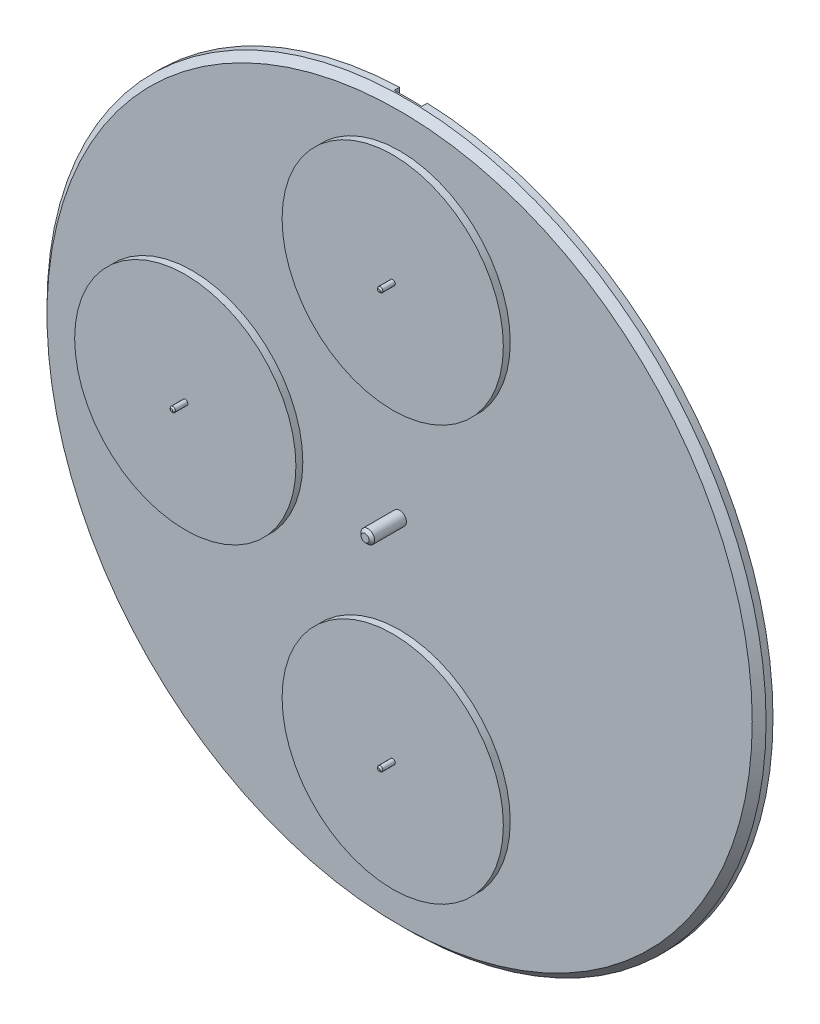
ISO-10303-21;
HEADER;
FILE_DESCRIPTION(('STEP AP214'),'2;1');
FILE_NAME('part.step','',(''),(''),'','','');
FILE_SCHEMA(('AUTOMOTIVE_DESIGN { 1 0 10303 214 1 1 1 1 }'));
ENDSEC;
DATA;
#1=APPLICATION_CONTEXT('core data for automotive mechanical design processes');
#2=APPLICATION_PROTOCOL_DEFINITION('international standard','automotive_design',2000,#1);
#3=PRODUCT_CONTEXT('',#1,'mechanical');
#4=PRODUCT('Part','Part','',(#3));
#5=PRODUCT_RELATED_PRODUCT_CATEGORY('part','',(#4));
#6=PRODUCT_DEFINITION_FORMATION('','',#4);
#7=PRODUCT_DEFINITION_CONTEXT('part definition',#1,'design');
#8=PRODUCT_DEFINITION('design','',#6,#7);
#9=PRODUCT_DEFINITION_SHAPE('','',#8);
#10=(LENGTH_UNIT() NAMED_UNIT(*) SI_UNIT(.MILLI.,.METRE.));
#11=(NAMED_UNIT(*) PLANE_ANGLE_UNIT() SI_UNIT($,.RADIAN.));
#12=(NAMED_UNIT(*) SI_UNIT($,.STERADIAN.) SOLID_ANGLE_UNIT());
#13=UNCERTAINTY_MEASURE_WITH_UNIT(LENGTH_MEASURE(1.E-05),#10,'distance_accuracy_value','');
#14=(GEOMETRIC_REPRESENTATION_CONTEXT(3) GLOBAL_UNCERTAINTY_ASSIGNED_CONTEXT((#13)) GLOBAL_UNIT_ASSIGNED_CONTEXT((#10,
#11,#12)) REPRESENTATION_CONTEXT('',''));
#15=CARTESIAN_POINT('',(0.,0.,0.));
#16=DIRECTION('',(0.,0.,1.));
#17=DIRECTION('',(1.,0.,0.));
#18=AXIS2_PLACEMENT_3D('',#15,#16,#17);
#19=CARTESIAN_POINT('',(0.,0.,0.));
#20=DIRECTION('',(0.,0.,1.));
#21=DIRECTION('',(1.,0.,0.));
#22=AXIS2_PLACEMENT_3D('',#19,#20,#21);
#23=PLANE('',#22);
#24=CARTESIAN_POINT('',(0.,0.,0.));
#25=DIRECTION('',(0.,0.,1.));
#26=DIRECTION('',(1.,0.,0.));
#27=AXIS2_PLACEMENT_3D('',#24,#25,#26);
#28=CIRCLE('',#27,12.75);
#29=CARTESIAN_POINT('',(12.75,0.,0.));
#30=VERTEX_POINT('',#29);
#31=EDGE_CURVE('E42',#30,#30,#28,.T.);
#32=ORIENTED_EDGE('',*,*,#31,.T.);
#33=EDGE_LOOP('',(#32));
#34=FACE_BOUND('',#33,.T.);
#35=CARTESIAN_POINT('',(0.,-7.5,0.));
#36=DIRECTION('',(0.,0.,1.));
#37=DIRECTION('',(1.,0.,0.));
#38=AXIS2_PLACEMENT_3D('',#35,#36,#37);
#39=CIRCLE('',#38,4.);
#40=CARTESIAN_POINT('',(4.,-7.5,0.));
#41=VERTEX_POINT('',#40);
#42=EDGE_CURVE('E113',#41,#41,#39,.T.);
#43=ORIENTED_EDGE('',*,*,#42,.F.);
#44=EDGE_LOOP('',(#43));
#45=FACE_BOUND('',#44,.T.);
#46=CARTESIAN_POINT('',(-7.5,0.,0.));
#47=DIRECTION('',(0.,0.,1.));
#48=DIRECTION('',(1.,0.,0.));
#49=AXIS2_PLACEMENT_3D('',#46,#47,#48);
#50=CIRCLE('',#49,4.);
#51=CARTESIAN_POINT('',(-3.5,0.,0.));
#52=VERTEX_POINT('',#51);
#53=EDGE_CURVE('E120',#52,#52,#50,.T.);
#54=ORIENTED_EDGE('',*,*,#53,.F.);
#55=EDGE_LOOP('',(#54));
#56=FACE_BOUND('',#55,.T.);
#57=CARTESIAN_POINT('',(0.,7.5,0.));
#58=DIRECTION('',(0.,0.,1.));
#59=DIRECTION('',(1.,0.,0.));
#60=AXIS2_PLACEMENT_3D('',#57,#58,#59);
#61=CIRCLE('',#60,4.);
#62=CARTESIAN_POINT('',(4.,7.5,0.));
#63=VERTEX_POINT('',#62);
#64=EDGE_CURVE('E112',#63,#63,#61,.T.);
#65=ORIENTED_EDGE('',*,*,#64,.F.);
#66=EDGE_LOOP('',(#65));
#67=FACE_BOUND('',#66,.T.);
#68=CARTESIAN_POINT('',(0.,0.,0.));
#69=DIRECTION('',(0.,0.,1.));
#70=DIRECTION('',(1.,0.,0.));
#71=AXIS2_PLACEMENT_3D('',#68,#69,#70);
#72=CIRCLE('',#71,0.245);
#73=CARTESIAN_POINT('',(0.245,0.,0.));
#74=VERTEX_POINT('',#73);
#75=EDGE_CURVE('E105',#74,#74,#72,.T.);
#76=ORIENTED_EDGE('',*,*,#75,.F.);
#77=EDGE_LOOP('',(#76));
#78=FACE_BOUND('',#77,.T.);
#79=ADVANCED_FACE('F34',(#34,#45,#56,#67,#78),#23,.T.);
#80=CARTESIAN_POINT('',(0.,-7.5,0.25));
#81=DIRECTION('',(0.,0.,1.));
#82=DIRECTION('',(1.,0.,0.));
#83=AXIS2_PLACEMENT_3D('',#80,#81,#82);
#84=PLANE('',#83);
#85=CARTESIAN_POINT('',(0.,-7.5,0.25));
#86=DIRECTION('',(0.,0.,1.));
#87=DIRECTION('',(1.,0.,0.));
#88=AXIS2_PLACEMENT_3D('',#85,#86,#87);
#89=CIRCLE('',#88,4.);
#90=CARTESIAN_POINT('',(4.,-7.5,0.25));
#91=VERTEX_POINT('',#90);
#92=EDGE_CURVE('E109',#91,#91,#89,.T.);
#93=ORIENTED_EDGE('',*,*,#92,.T.);
#94=EDGE_LOOP('',(#93));
#95=FACE_BOUND('',#94,.T.);
#96=CARTESIAN_POINT('',(0.,-7.5,0.25));
#97=DIRECTION('',(0.,0.,1.));
#98=DIRECTION('',(1.,0.,0.));
#99=AXIS2_PLACEMENT_3D('',#96,#97,#98);
#100=CIRCLE('',#99,0.0937500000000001);
#101=CARTESIAN_POINT('',(0.0937500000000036,-7.5,0.25));
#102=VERTEX_POINT('',#101);
#103=EDGE_CURVE('E108',#102,#102,#100,.F.);
#104=ORIENTED_EDGE('',*,*,#103,.T.);
#105=EDGE_LOOP('',(#104));
#106=FACE_BOUND('',#105,.T.);
#107=ADVANCED_FACE('F178',(#95,#106),#84,.T.);
#108=CARTESIAN_POINT('',(0.,7.5,0.25));
#109=DIRECTION('',(0.,0.,1.));
#110=DIRECTION('',(1.,0.,0.));
#111=AXIS2_PLACEMENT_3D('',#108,#109,#110);
#112=PLANE('',#111);
#113=CARTESIAN_POINT('',(0.,7.5,0.25));
#114=DIRECTION('',(0.,0.,1.));
#115=DIRECTION('',(1.,0.,0.));
#116=AXIS2_PLACEMENT_3D('',#113,#114,#115);
#117=CIRCLE('',#116,4.);
#118=CARTESIAN_POINT('',(4.,7.5,0.25));
#119=VERTEX_POINT('',#118);
#120=EDGE_CURVE('E117',#119,#119,#117,.T.);
#121=ORIENTED_EDGE('',*,*,#120,.T.);
#122=EDGE_LOOP('',(#121));
#123=FACE_BOUND('',#122,.T.);
#124=CARTESIAN_POINT('',(0.,7.5,0.25));
#125=DIRECTION('',(0.,0.,1.));
#126=DIRECTION('',(1.,0.,0.));
#127=AXIS2_PLACEMENT_3D('',#124,#125,#126);
#128=CIRCLE('',#127,0.0937500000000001);
#129=CARTESIAN_POINT('',(0.0937500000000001,7.5,0.25));
#130=VERTEX_POINT('',#129);
#131=EDGE_CURVE('E133',#130,#130,#128,.F.);
#132=ORIENTED_EDGE('',*,*,#131,.T.);
#133=EDGE_LOOP('',(#132));
#134=FACE_BOUND('',#133,.T.);
#135=ADVANCED_FACE('F183',(#123,#134),#112,.T.);
#136=CARTESIAN_POINT('',(-7.5,0.,0.25));
#137=DIRECTION('',(0.,0.,1.));
#138=DIRECTION('',(1.,0.,0.));
#139=AXIS2_PLACEMENT_3D('',#136,#137,#138);
#140=PLANE('',#139);
#141=CARTESIAN_POINT('',(-7.5,0.,0.25));
#142=DIRECTION('',(0.,0.,1.));
#143=DIRECTION('',(1.,0.,0.));
#144=AXIS2_PLACEMENT_3D('',#141,#142,#143);
#145=CIRCLE('',#144,4.);
#146=CARTESIAN_POINT('',(-3.5,0.,0.25));
#147=VERTEX_POINT('',#146);
#148=EDGE_CURVE('E123',#147,#147,#145,.T.);
#149=ORIENTED_EDGE('',*,*,#148,.T.);
#150=EDGE_LOOP('',(#149));
#151=FACE_BOUND('',#150,.T.);
#152=CARTESIAN_POINT('',(-7.5,0.,0.25));
#153=DIRECTION('',(0.,0.,1.));
#154=DIRECTION('',(1.,0.,0.));
#155=AXIS2_PLACEMENT_3D('',#152,#153,#154);
#156=CIRCLE('',#155,0.0937499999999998);
#157=CARTESIAN_POINT('',(-7.40625,0.,0.25));
#158=VERTEX_POINT('',#157);
#159=EDGE_CURVE('E116',#158,#158,#156,.F.);
#160=ORIENTED_EDGE('',*,*,#159,.T.);
#161=EDGE_LOOP('',(#160));
#162=FACE_BOUND('',#161,.T.);
#163=ADVANCED_FACE('F193',(#151,#162),#140,.T.);
#164=CARTESIAN_POINT('',(0.,0.,-0.5));
#165=DIRECTION('',(0.,0.,1.));
#166=DIRECTION('',(1.,0.,0.));
#167=AXIS2_PLACEMENT_3D('',#164,#165,#166);
#168=CYLINDRICAL_SURFACE('',#167,13.);
#169=CARTESIAN_POINT('',(0.,0.,-0.250000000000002));
#170=DIRECTION('',(0.,0.,1.));
#171=DIRECTION('',(1.,0.,0.));
#172=AXIS2_PLACEMENT_3D('',#169,#170,#171);
#173=CIRCLE('',#172,13.);
#174=CARTESIAN_POINT('',(13.,0.,-0.250000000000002));
#175=VERTEX_POINT('',#174);
#176=EDGE_CURVE('E11',#175,#175,#173,.F.);
#177=ORIENTED_EDGE('',*,*,#176,.T.);
#178=EDGE_LOOP('',(#177));
#179=FACE_BOUND('',#178,.T.);
#180=DIRECTION('',(0.,0.,1.));
#181=VECTOR('',#180,1.);
#182=CARTESIAN_POINT('',(-0.5,12.9903810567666,-0.5));
#183=LINE('',#182,#181);
#184=CARTESIAN_POINT('',(-0.5,12.9903810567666,-0.5));
#185=VERTEX_POINT('',#184);
#186=CARTESIAN_POINT('',(-0.5,12.9903810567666,-0.3));
#187=VERTEX_POINT('',#186);
#188=EDGE_CURVE('E57',#185,#187,#183,.T.);
#189=ORIENTED_EDGE('',*,*,#188,.F.);
#190=CARTESIAN_POINT('',(0.,0.,-0.5));
#191=DIRECTION('',(0.,0.,1.));
#192=DIRECTION('',(1.,0.,0.));
#193=AXIS2_PLACEMENT_3D('',#190,#191,#192);
#194=CIRCLE('',#193,13.);
#195=CARTESIAN_POINT('',(0.5,12.9903810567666,-0.5));
#196=VERTEX_POINT('',#195);
#197=EDGE_CURVE('E126',#185,#196,#194,.T.);
#198=ORIENTED_EDGE('',*,*,#197,.T.);
#199=DIRECTION('',(0.,0.,1.));
#200=VECTOR('',#199,1.);
#201=CARTESIAN_POINT('',(0.5,12.9903810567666,-0.5));
#202=LINE('',#201,#200);
#203=CARTESIAN_POINT('',(0.5,12.9903810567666,-0.3));
#204=VERTEX_POINT('',#203);
#205=EDGE_CURVE('E49',#204,#196,#202,.F.);
#206=ORIENTED_EDGE('',*,*,#205,.F.);
#207=CARTESIAN_POINT('',(0.,0.,-0.3));
#208=DIRECTION('',(0.,0.,-1.));
#209=DIRECTION('',(-1.,0.,0.));
#210=AXIS2_PLACEMENT_3D('',#207,#208,#209);
#211=CIRCLE('',#210,13.);
#212=EDGE_CURVE('E82',#204,#187,#211,.F.);
#213=ORIENTED_EDGE('',*,*,#212,.T.);
#214=EDGE_LOOP('',(#189,#198,#206,#213));
#215=FACE_BOUND('',#214,.T.);
#216=ADVANCED_FACE('F190',(#179,#215),#168,.T.);
#217=CARTESIAN_POINT('',(0.,0.,-0.5));
#218=DIRECTION('',(0.,0.,1.));
#219=DIRECTION('',(1.,0.,0.));
#220=AXIS2_PLACEMENT_3D('',#217,#218,#219);
#221=PLANE('',#220);
#222=ORIENTED_EDGE('',*,*,#197,.F.);
#223=DIRECTION('',(0.,1.,0.));
#224=VECTOR('',#223,1.);
#225=CARTESIAN_POINT('',(-0.5,12.,-0.5));
#226=LINE('',#225,#224);
#227=CARTESIAN_POINT('',(-0.5,12.,-0.5));
#228=VERTEX_POINT('',#227);
#229=EDGE_CURVE('E98',#228,#185,#226,.T.);
#230=ORIENTED_EDGE('',*,*,#229,.F.);
#231=DIRECTION('',(-1.,0.,0.));
#232=VECTOR('',#231,1.);
#233=CARTESIAN_POINT('',(-0.5,12.,-0.5));
#234=LINE('',#233,#232);
#235=CARTESIAN_POINT('',(0.5,12.,-0.5));
#236=VERTEX_POINT('',#235);
#237=EDGE_CURVE('E100',#236,#228,#234,.T.);
#238=ORIENTED_EDGE('',*,*,#237,.F.);
#239=DIRECTION('',(0.,1.,0.));
#240=VECTOR('',#239,1.);
#241=CARTESIAN_POINT('',(0.5,0.,-0.5));
#242=LINE('',#241,#240);
#243=EDGE_CURVE('E88',#236,#196,#242,.T.);
#244=ORIENTED_EDGE('',*,*,#243,.T.);
#245=EDGE_LOOP('',(#222,#230,#238,#244));
#246=FACE_BOUND('',#245,.T.);
#247=ADVANCED_FACE('F188',(#246),#221,.F.);
#248=CARTESIAN_POINT('',(-7.5,0.,0.25));
#249=DIRECTION('',(0.,0.,-1.));
#250=DIRECTION('',(-1.,0.,0.));
#251=AXIS2_PLACEMENT_3D('',#248,#249,#250);
#252=CYLINDRICAL_SURFACE('',#251,4.);
#253=ORIENTED_EDGE('',*,*,#148,.F.);
#254=EDGE_LOOP('',(#253));
#255=FACE_BOUND('',#254,.T.);
#256=ORIENTED_EDGE('',*,*,#53,.T.);
#257=EDGE_LOOP('',(#256));
#258=FACE_BOUND('',#257,.T.);
#259=ADVANCED_FACE('F253',(#255,#258),#252,.T.);
#260=CARTESIAN_POINT('',(0.,7.5,0.25));
#261=DIRECTION('',(0.,0.,-1.));
#262=DIRECTION('',(-1.,0.,0.));
#263=AXIS2_PLACEMENT_3D('',#260,#261,#262);
#264=CYLINDRICAL_SURFACE('',#263,4.);
#265=ORIENTED_EDGE('',*,*,#120,.F.);
#266=EDGE_LOOP('',(#265));
#267=FACE_BOUND('',#266,.T.);
#268=ORIENTED_EDGE('',*,*,#64,.T.);
#269=EDGE_LOOP('',(#268));
#270=FACE_BOUND('',#269,.T.);
#271=ADVANCED_FACE('F246',(#267,#270),#264,.T.);
#272=CARTESIAN_POINT('',(0.,-7.5,0.25));
#273=DIRECTION('',(0.,0.,-1.));
#274=DIRECTION('',(-1.,0.,0.));
#275=AXIS2_PLACEMENT_3D('',#272,#273,#274);
#276=CYLINDRICAL_SURFACE('',#275,4.);
#277=ORIENTED_EDGE('',*,*,#92,.F.);
#278=EDGE_LOOP('',(#277));
#279=FACE_BOUND('',#278,.T.);
#280=ORIENTED_EDGE('',*,*,#42,.T.);
#281=EDGE_LOOP('',(#280));
#282=FACE_BOUND('',#281,.T.);
#283=ADVANCED_FACE('F241',(#279,#282),#276,.T.);
#284=CARTESIAN_POINT('',(-7.5,0.,0.75));
#285=DIRECTION('',(0.,0.,-1.));
#286=DIRECTION('',(-1.,0.,0.));
#287=AXIS2_PLACEMENT_3D('',#284,#285,#286);
#288=CYLINDRICAL_SURFACE('',#287,0.0937499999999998);
#289=CARTESIAN_POINT('',(-7.5,0.,0.7));
#290=DIRECTION('',(0.,0.,1.));
#291=DIRECTION('',(1.,0.,0.));
#292=AXIS2_PLACEMENT_3D('',#289,#290,#291);
#293=CIRCLE('',#292,0.0937499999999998);
#294=CARTESIAN_POINT('',(-7.40625,0.,0.7));
#295=VERTEX_POINT('',#294);
#296=EDGE_CURVE('E161',#295,#295,#293,.F.);
#297=ORIENTED_EDGE('',*,*,#296,.T.);
#298=EDGE_LOOP('',(#297));
#299=FACE_BOUND('',#298,.T.);
#300=ORIENTED_EDGE('',*,*,#159,.F.);
#301=EDGE_LOOP('',(#300));
#302=FACE_BOUND('',#301,.T.);
#303=ADVANCED_FACE('F238',(#299,#302),#288,.T.);
#304=CARTESIAN_POINT('',(-7.5,0.,0.75));
#305=DIRECTION('',(0.,0.,1.));
#306=DIRECTION('',(1.,0.,0.));
#307=AXIS2_PLACEMENT_3D('',#304,#305,#306);
#308=PLANE('',#307);
#309=CARTESIAN_POINT('',(-7.5,0.,0.75));
#310=DIRECTION('',(0.,0.,1.));
#311=DIRECTION('',(1.,0.,0.));
#312=AXIS2_PLACEMENT_3D('',#309,#310,#311);
#313=CIRCLE('',#312,0.0437499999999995);
#314=CARTESIAN_POINT('',(-7.45625,0.,0.75));
#315=VERTEX_POINT('',#314);
#316=EDGE_CURVE('E158',#315,#315,#313,.T.);
#317=ORIENTED_EDGE('',*,*,#316,.T.);
#318=EDGE_LOOP('',(#317));
#319=FACE_BOUND('',#318,.T.);
#320=ADVANCED_FACE('F234',(#319),#308,.T.);
#321=CARTESIAN_POINT('',(0.,7.5,0.75));
#322=DIRECTION('',(0.,0.,-1.));
#323=DIRECTION('',(-1.,0.,0.));
#324=AXIS2_PLACEMENT_3D('',#321,#322,#323);
#325=CYLINDRICAL_SURFACE('',#324,0.0937500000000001);
#326=CARTESIAN_POINT('',(0.,7.5,0.7));
#327=DIRECTION('',(0.,0.,1.));
#328=DIRECTION('',(1.,0.,0.));
#329=AXIS2_PLACEMENT_3D('',#326,#327,#328);
#330=CIRCLE('',#329,0.0937500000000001);
#331=CARTESIAN_POINT('',(0.0937500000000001,7.5,0.7));
#332=VERTEX_POINT('',#331);
#333=EDGE_CURVE('E149',#332,#332,#330,.F.);
#334=ORIENTED_EDGE('',*,*,#333,.T.);
#335=EDGE_LOOP('',(#334));
#336=FACE_BOUND('',#335,.T.);
#337=ORIENTED_EDGE('',*,*,#131,.F.);
#338=EDGE_LOOP('',(#337));
#339=FACE_BOUND('',#338,.T.);
#340=ADVANCED_FACE('F230',(#336,#339),#325,.T.);
#341=CARTESIAN_POINT('',(0.,7.5,0.75));
#342=DIRECTION('',(0.,0.,1.));
#343=DIRECTION('',(1.,0.,0.));
#344=AXIS2_PLACEMENT_3D('',#341,#342,#343);
#345=PLANE('',#344);
#346=CARTESIAN_POINT('',(0.,7.5,0.75));
#347=DIRECTION('',(0.,0.,1.));
#348=DIRECTION('',(1.,0.,0.));
#349=AXIS2_PLACEMENT_3D('',#346,#347,#348);
#350=CIRCLE('',#349,0.0437500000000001);
#351=CARTESIAN_POINT('',(0.0437500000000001,7.5,0.75));
#352=VERTEX_POINT('',#351);
#353=EDGE_CURVE('E146',#352,#352,#350,.T.);
#354=ORIENTED_EDGE('',*,*,#353,.T.);
#355=EDGE_LOOP('',(#354));
#356=FACE_BOUND('',#355,.T.);
#357=ADVANCED_FACE('F223',(#356),#345,.T.);
#358=CARTESIAN_POINT('',(0.,-7.5,0.75));
#359=DIRECTION('',(0.,0.,-1.));
#360=DIRECTION('',(-1.,0.,0.));
#361=AXIS2_PLACEMENT_3D('',#358,#359,#360);
#362=CYLINDRICAL_SURFACE('',#361,0.0937500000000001);
#363=CARTESIAN_POINT('',(0.,-7.5,0.7));
#364=DIRECTION('',(0.,0.,1.));
#365=DIRECTION('',(1.,0.,0.));
#366=AXIS2_PLACEMENT_3D('',#363,#364,#365);
#367=CIRCLE('',#366,0.0937500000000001);
#368=CARTESIAN_POINT('',(0.0937500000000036,-7.5,0.7));
#369=VERTEX_POINT('',#368);
#370=EDGE_CURVE('E155',#369,#369,#367,.F.);
#371=ORIENTED_EDGE('',*,*,#370,.T.);
#372=EDGE_LOOP('',(#371));
#373=FACE_BOUND('',#372,.T.);
#374=ORIENTED_EDGE('',*,*,#103,.F.);
#375=EDGE_LOOP('',(#374));
#376=FACE_BOUND('',#375,.T.);
#377=ADVANCED_FACE('F214',(#373,#376),#362,.T.);
#378=CARTESIAN_POINT('',(0.,-7.5,0.75));
#379=DIRECTION('',(0.,0.,1.));
#380=DIRECTION('',(1.,0.,0.));
#381=AXIS2_PLACEMENT_3D('',#378,#379,#380);
#382=PLANE('',#381);
#383=CARTESIAN_POINT('',(0.,-7.5,0.75));
#384=DIRECTION('',(0.,0.,1.));
#385=DIRECTION('',(1.,0.,0.));
#386=AXIS2_PLACEMENT_3D('',#383,#384,#385);
#387=CIRCLE('',#386,0.0437500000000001);
#388=CARTESIAN_POINT('',(0.0437500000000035,-7.5,0.75));
#389=VERTEX_POINT('',#388);
#390=EDGE_CURVE('E152',#389,#389,#387,.T.);
#391=ORIENTED_EDGE('',*,*,#390,.T.);
#392=EDGE_LOOP('',(#391));
#393=FACE_BOUND('',#392,.T.);
#394=ADVANCED_FACE('F211',(#393),#382,.T.);
#395=CARTESIAN_POINT('',(0.,0.,1.25));
#396=DIRECTION('',(0.,0.,-1.));
#397=DIRECTION('',(-1.,0.,0.));
#398=AXIS2_PLACEMENT_3D('',#395,#396,#397);
#399=CYLINDRICAL_SURFACE('',#398,0.245);
#400=CARTESIAN_POINT('',(0.,0.,1.15));
#401=DIRECTION('',(0.,0.,1.));
#402=DIRECTION('',(1.,0.,0.));
#403=AXIS2_PLACEMENT_3D('',#400,#401,#402);
#404=CIRCLE('',#403,0.245);
#405=CARTESIAN_POINT('',(0.245,0.,1.15));
#406=VERTEX_POINT('',#405);
#407=EDGE_CURVE('E143',#406,#406,#404,.F.);
#408=ORIENTED_EDGE('',*,*,#407,.T.);
#409=EDGE_LOOP('',(#408));
#410=FACE_BOUND('',#409,.T.);
#411=ORIENTED_EDGE('',*,*,#75,.T.);
#412=EDGE_LOOP('',(#411));
#413=FACE_BOUND('',#412,.T.);
#414=ADVANCED_FACE('F213',(#410,#413),#399,.T.);
#415=CARTESIAN_POINT('',(0.,0.,1.25));
#416=DIRECTION('',(0.,0.,1.));
#417=DIRECTION('',(1.,0.,0.));
#418=AXIS2_PLACEMENT_3D('',#415,#416,#417);
#419=PLANE('',#418);
#420=CARTESIAN_POINT('',(0.,0.,1.25));
#421=DIRECTION('',(0.,0.,1.));
#422=DIRECTION('',(1.,0.,0.));
#423=AXIS2_PLACEMENT_3D('',#420,#421,#422);
#424=CIRCLE('',#423,0.145);
#425=CARTESIAN_POINT('',(0.145,0.,1.25));
#426=VERTEX_POINT('',#425);
#427=EDGE_CURVE('E140',#426,#426,#424,.T.);
#428=ORIENTED_EDGE('',*,*,#427,.T.);
#429=EDGE_LOOP('',(#428));
#430=FACE_BOUND('',#429,.T.);
#431=ADVANCED_FACE('F220',(#430),#419,.T.);
#432=CARTESIAN_POINT('',(-0.5,12.,-0.3));
#433=DIRECTION('',(-1.,0.,0.));
#434=DIRECTION('',(0.,0.,1.));
#435=AXIS2_PLACEMENT_3D('',#432,#433,#434);
#436=PLANE('',#435);
#437=ORIENTED_EDGE('',*,*,#188,.T.);
#438=DIRECTION('',(0.,1.,0.));
#439=VECTOR('',#438,1.);
#440=CARTESIAN_POINT('',(-0.5,12.,-0.3));
#441=LINE('',#440,#439);
#442=CARTESIAN_POINT('',(-0.5,12.,-0.3));
#443=VERTEX_POINT('',#442);
#444=EDGE_CURVE('E83',#443,#187,#441,.T.);
#445=ORIENTED_EDGE('',*,*,#444,.F.);
#446=DIRECTION('',(0.,0.,-1.));
#447=VECTOR('',#446,1.);
#448=CARTESIAN_POINT('',(-0.5,12.,-0.3));
#449=LINE('',#448,#447);
#450=EDGE_CURVE('E92',#443,#228,#449,.T.);
#451=ORIENTED_EDGE('',*,*,#450,.T.);
#452=ORIENTED_EDGE('',*,*,#229,.T.);
#453=EDGE_LOOP('',(#437,#445,#451,#452));
#454=FACE_BOUND('',#453,.T.);
#455=ADVANCED_FACE('F281',(#454),#436,.F.);
#456=CARTESIAN_POINT('',(-0.5,12.,-0.3));
#457=DIRECTION('',(0.,-1.,0.));
#458=DIRECTION('',(0.,0.,-1.));
#459=AXIS2_PLACEMENT_3D('',#456,#457,#458);
#460=PLANE('',#459);
#461=ORIENTED_EDGE('',*,*,#237,.T.);
#462=ORIENTED_EDGE('',*,*,#450,.F.);
#463=DIRECTION('',(-1.,0.,0.));
#464=VECTOR('',#463,1.);
#465=CARTESIAN_POINT('',(-0.5,12.,-0.3));
#466=LINE('',#465,#464);
#467=CARTESIAN_POINT('',(0.5,12.,-0.3));
#468=VERTEX_POINT('',#467);
#469=EDGE_CURVE('E80',#468,#443,#466,.T.);
#470=ORIENTED_EDGE('',*,*,#469,.F.);
#471=DIRECTION('',(0.,0.,-1.));
#472=VECTOR('',#471,1.);
#473=CARTESIAN_POINT('',(0.5,12.,-0.3));
#474=LINE('',#473,#472);
#475=EDGE_CURVE('E86',#468,#236,#474,.T.);
#476=ORIENTED_EDGE('',*,*,#475,.T.);
#477=EDGE_LOOP('',(#461,#462,#470,#476));
#478=FACE_BOUND('',#477,.T.);
#479=ADVANCED_FACE('F94',(#478),#460,.F.);
#480=CARTESIAN_POINT('',(0.5,12.,-0.3));
#481=DIRECTION('',(1.,0.,0.));
#482=DIRECTION('',(0.,0.,-1.));
#483=AXIS2_PLACEMENT_3D('',#480,#481,#482);
#484=PLANE('',#483);
#485=ORIENTED_EDGE('',*,*,#205,.T.);
#486=ORIENTED_EDGE('',*,*,#243,.F.);
#487=ORIENTED_EDGE('',*,*,#475,.F.);
#488=DIRECTION('',(0.,-1.,0.));
#489=VECTOR('',#488,1.);
#490=CARTESIAN_POINT('',(0.5,12.,-0.3));
#491=LINE('',#490,#489);
#492=EDGE_CURVE('E76',#204,#468,#491,.T.);
#493=ORIENTED_EDGE('',*,*,#492,.F.);
#494=EDGE_LOOP('',(#485,#486,#487,#493));
#495=FACE_BOUND('',#494,.T.);
#496=ADVANCED_FACE('F87',(#495),#484,.F.);
#497=CARTESIAN_POINT('',(-0.5,14.,-0.3));
#498=DIRECTION('',(0.,0.,-1.));
#499=DIRECTION('',(-1.,0.,0.));
#500=AXIS2_PLACEMENT_3D('',#497,#498,#499);
#501=PLANE('',#500);
#502=ORIENTED_EDGE('',*,*,#492,.T.);
#503=ORIENTED_EDGE('',*,*,#469,.T.);
#504=ORIENTED_EDGE('',*,*,#444,.T.);
#505=ORIENTED_EDGE('',*,*,#212,.F.);
#506=EDGE_LOOP('',(#502,#503,#504,#505));
#507=FACE_BOUND('',#506,.T.);
#508=ADVANCED_FACE('F78',(#507),#501,.T.);
#509=CARTESIAN_POINT('',(0.,0.,1.25));
#510=DIRECTION('',(0.,0.,-1.));
#511=DIRECTION('',(-1.,0.,0.));
#512=AXIS2_PLACEMENT_3D('',#509,#510,#511);
#513=CONICAL_SURFACE('',#512,0.145,0.785398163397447);
#514=ORIENTED_EDGE('',*,*,#407,.F.);
#515=EDGE_LOOP('',(#514));
#516=FACE_BOUND('',#515,.T.);
#517=ORIENTED_EDGE('',*,*,#427,.F.);
#518=EDGE_LOOP('',(#517));
#519=FACE_BOUND('',#518,.T.);
#520=ADVANCED_FACE('F195',(#516,#519),#513,.T.);
#521=CARTESIAN_POINT('',(0.,7.5,0.75));
#522=DIRECTION('',(0.,0.,-1.));
#523=DIRECTION('',(-1.,0.,0.));
#524=AXIS2_PLACEMENT_3D('',#521,#522,#523);
#525=CONICAL_SURFACE('',#524,0.0437500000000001,0.785398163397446);
#526=ORIENTED_EDGE('',*,*,#333,.F.);
#527=EDGE_LOOP('',(#526));
#528=FACE_BOUND('',#527,.T.);
#529=ORIENTED_EDGE('',*,*,#353,.F.);
#530=EDGE_LOOP('',(#529));
#531=FACE_BOUND('',#530,.T.);
#532=ADVANCED_FACE('F198',(#528,#531),#525,.T.);
#533=CARTESIAN_POINT('',(0.,-7.5,0.75));
#534=DIRECTION('',(0.,0.,-1.));
#535=DIRECTION('',(-1.,0.,0.));
#536=AXIS2_PLACEMENT_3D('',#533,#534,#535);
#537=CONICAL_SURFACE('',#536,0.0437500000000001,0.785398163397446);
#538=ORIENTED_EDGE('',*,*,#370,.F.);
#539=EDGE_LOOP('',(#538));
#540=FACE_BOUND('',#539,.T.);
#541=ORIENTED_EDGE('',*,*,#390,.F.);
#542=EDGE_LOOP('',(#541));
#543=FACE_BOUND('',#542,.T.);
#544=ADVANCED_FACE('F174',(#540,#543),#537,.T.);
#545=CARTESIAN_POINT('',(-7.5,0.,0.75));
#546=DIRECTION('',(0.,0.,-1.));
#547=DIRECTION('',(-1.,0.,0.));
#548=AXIS2_PLACEMENT_3D('',#545,#546,#547);
#549=CONICAL_SURFACE('',#548,0.0437499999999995,0.785398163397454);
#550=ORIENTED_EDGE('',*,*,#296,.F.);
#551=EDGE_LOOP('',(#550));
#552=FACE_BOUND('',#551,.T.);
#553=ORIENTED_EDGE('',*,*,#316,.F.);
#554=EDGE_LOOP('',(#553));
#555=FACE_BOUND('',#554,.T.);
#556=ADVANCED_FACE('F169',(#552,#555),#549,.T.);
#557=CARTESIAN_POINT('',(0.,0.,0.));
#558=DIRECTION('',(0.,0.,-1.));
#559=DIRECTION('',(-1.,0.,0.));
#560=AXIS2_PLACEMENT_3D('',#557,#558,#559);
#561=CONICAL_SURFACE('',#560,12.75,0.785398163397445);
#562=ORIENTED_EDGE('',*,*,#176,.F.);
#563=EDGE_LOOP('',(#562));
#564=FACE_BOUND('',#563,.T.);
#565=ORIENTED_EDGE('',*,*,#31,.F.);
#566=EDGE_LOOP('',(#565));
#567=FACE_BOUND('',#566,.T.);
#568=ADVANCED_FACE('F36',(#564,#567),#561,.T.);
#569=CLOSED_SHELL('',(#79,#107,#135,#163,#216,#247,#259,#271,#283,#303,#320,#340,#357,#377,#394,
#414,#431,#455,#479,#496,#508,#520,#532,#544,#556,#568));
#570=MANIFOLD_SOLID_BREP('B2',#569);
#571=ADVANCED_BREP_SHAPE_REPRESENTATION('',(#18,#570),#14);
#572=SHAPE_DEFINITION_REPRESENTATION(#9,#571);
ENDSEC;
END-ISO-10303-21;
